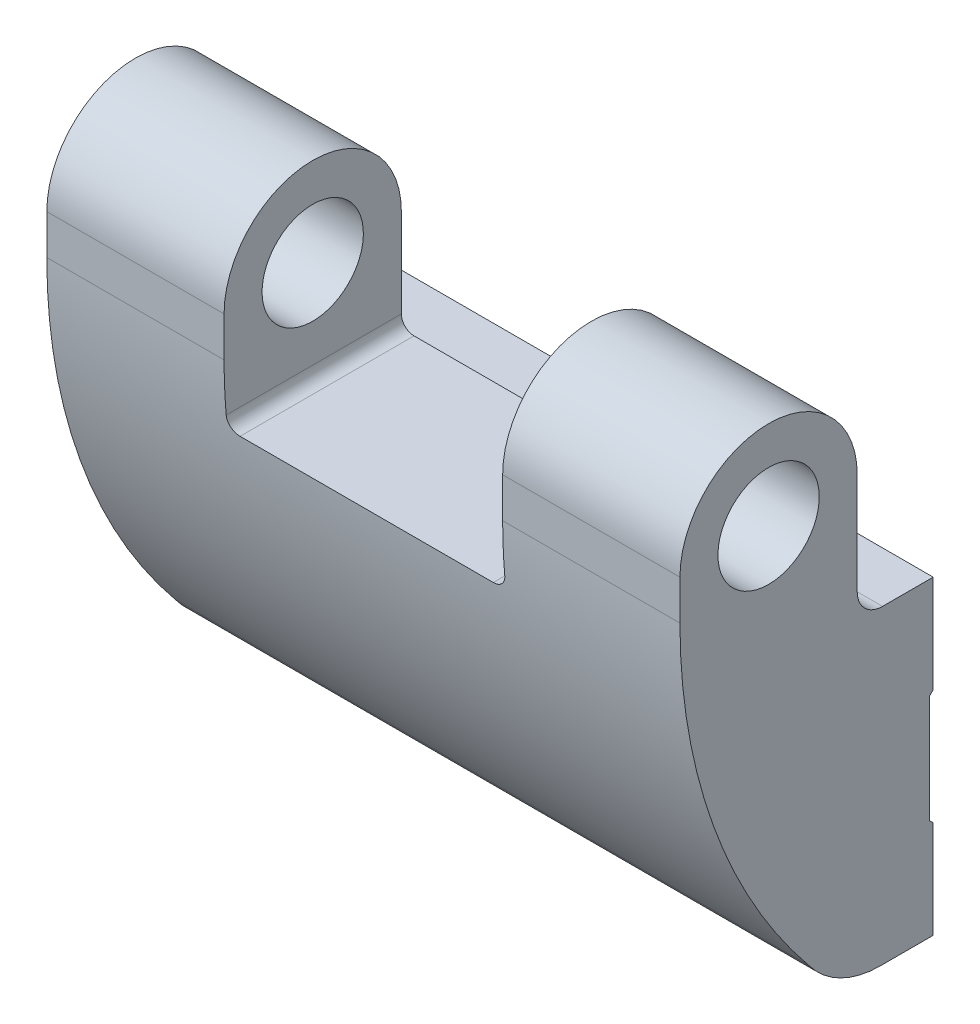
ISO-10303-21;
HEADER;
FILE_DESCRIPTION(('STEP AP214'),'2;1');
FILE_NAME('part.step','',(''),(''),'','','');
FILE_SCHEMA(('AUTOMOTIVE_DESIGN { 1 0 10303 214 1 1 1 1 }'));
ENDSEC;
DATA;
#1=APPLICATION_CONTEXT('core data for automotive mechanical design processes');
#2=APPLICATION_PROTOCOL_DEFINITION('international standard','automotive_design',2000,#1);
#3=PRODUCT_CONTEXT('',#1,'mechanical');
#4=PRODUCT('Part','Part','',(#3));
#5=PRODUCT_RELATED_PRODUCT_CATEGORY('part','',(#4));
#6=PRODUCT_DEFINITION_FORMATION('','',#4);
#7=PRODUCT_DEFINITION_CONTEXT('part definition',#1,'design');
#8=PRODUCT_DEFINITION('design','',#6,#7);
#9=PRODUCT_DEFINITION_SHAPE('','',#8);
#10=(LENGTH_UNIT() NAMED_UNIT(*) SI_UNIT(.MILLI.,.METRE.));
#11=(NAMED_UNIT(*) PLANE_ANGLE_UNIT() SI_UNIT($,.RADIAN.));
#12=(NAMED_UNIT(*) SI_UNIT($,.STERADIAN.) SOLID_ANGLE_UNIT());
#13=UNCERTAINTY_MEASURE_WITH_UNIT(LENGTH_MEASURE(1.E-05),#10,'distance_accuracy_value','');
#14=(GEOMETRIC_REPRESENTATION_CONTEXT(3) GLOBAL_UNCERTAINTY_ASSIGNED_CONTEXT((#13)) GLOBAL_UNIT_ASSIGNED_CONTEXT((#10,
#11,#12)) REPRESENTATION_CONTEXT('',''));
#15=CARTESIAN_POINT('',(0.,0.,0.));
#16=DIRECTION('',(0.,0.,1.));
#17=DIRECTION('',(1.,0.,0.));
#18=AXIS2_PLACEMENT_3D('',#15,#16,#17);
#19=CARTESIAN_POINT('',(-8.5,20.8580531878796,20.));
#20=DIRECTION('',(0.,0.,-1.));
#21=DIRECTION('',(1.,0.,0.));
#22=AXIS2_PLACEMENT_3D('',#19,#20,#21);
#23=PLANE('',#22);
#24=DIRECTION('',(0.,1.,0.));
#25=VECTOR('',#24,1.);
#26=CARTESIAN_POINT('',(27.5,17.,20.));
#27=LINE('',#26,#25);
#28=CARTESIAN_POINT('',(27.5,20.8580531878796,20.));
#29=VERTEX_POINT('',#28);
#30=CARTESIAN_POINT('',(27.5,24.,20.));
#31=VERTEX_POINT('',#30);
#32=EDGE_CURVE('E155',#29,#31,#27,.T.);
#33=ORIENTED_EDGE('',*,*,#32,.F.);
#34=DIRECTION('',(1.,0.,0.));
#35=VECTOR('',#34,1.);
#36=CARTESIAN_POINT('',(-8.5,20.8580531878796,20.));
#37=LINE('',#36,#35);
#38=CARTESIAN_POINT('',(41.5,20.8580531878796,20.));
#39=VERTEX_POINT('',#38);
#40=EDGE_CURVE('E165',#29,#39,#37,.T.);
#41=ORIENTED_EDGE('',*,*,#40,.T.);
#42=DIRECTION('',(0.,1.,0.));
#43=VECTOR('',#42,1.);
#44=CARTESIAN_POINT('',(41.5,20.8580531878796,20.));
#45=LINE('',#44,#43);
#46=CARTESIAN_POINT('',(41.5,24.,20.));
#47=VERTEX_POINT('',#46);
#48=EDGE_CURVE('E306',#39,#47,#45,.T.);
#49=ORIENTED_EDGE('',*,*,#48,.T.);
#50=DIRECTION('',(1.,0.,0.));
#51=VECTOR('',#50,1.);
#52=CARTESIAN_POINT('',(-8.5,24.,20.));
#53=LINE('',#52,#51);
#54=EDGE_CURVE('E167',#31,#47,#53,.T.);
#55=ORIENTED_EDGE('',*,*,#54,.F.);
#56=EDGE_LOOP('',(#33,#41,#49,#55));
#57=FACE_BOUND('',#56,.T.);
#58=ADVANCED_FACE('F14',(#57),#23,.F.);
#59=DIRECTION('',(0.,-1.,0.));
#60=VECTOR('',#59,1.);
#61=CARTESIAN_POINT('',(5.5,31.,20.));
#62=LINE('',#61,#60);
#63=CARTESIAN_POINT('',(5.5,24.,20.));
#64=VERTEX_POINT('',#63);
#65=CARTESIAN_POINT('',(5.5,20.8580531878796,20.));
#66=VERTEX_POINT('',#65);
#67=EDGE_CURVE('E168',#64,#66,#62,.T.);
#68=ORIENTED_EDGE('',*,*,#67,.F.);
#69=CARTESIAN_POINT('',(-8.5,24.,20.));
#70=VERTEX_POINT('',#69);
#71=EDGE_CURVE('E221',#70,#64,#53,.T.);
#72=ORIENTED_EDGE('',*,*,#71,.F.);
#73=DIRECTION('',(0.,1.,0.));
#74=VECTOR('',#73,1.);
#75=CARTESIAN_POINT('',(-8.5,20.8580531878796,20.));
#76=LINE('',#75,#74);
#77=CARTESIAN_POINT('',(-8.5,20.8580531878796,20.));
#78=VERTEX_POINT('',#77);
#79=EDGE_CURVE('E307',#78,#70,#76,.T.);
#80=ORIENTED_EDGE('',*,*,#79,.F.);
#81=EDGE_CURVE('E175',#78,#66,#37,.T.);
#82=ORIENTED_EDGE('',*,*,#81,.T.);
#83=EDGE_LOOP('',(#68,#72,#80,#82));
#84=FACE_BOUND('',#83,.T.);
#85=ADVANCED_FACE('F385',(#84),#23,.F.);
#86=CARTESIAN_POINT('',(-8.5,24.,13.));
#87=DIRECTION('',(1.,0.,0.));
#88=DIRECTION('',(0.,1.,0.));
#89=AXIS2_PLACEMENT_3D('',#86,#87,#88);
#90=CYLINDRICAL_SURFACE('',#89,7.);
#91=CARTESIAN_POINT('',(27.5,24.,13.));
#92=DIRECTION('',(-1.,0.,0.));
#93=DIRECTION('',(0.,-1.,0.));
#94=AXIS2_PLACEMENT_3D('',#91,#92,#93);
#95=CIRCLE('',#94,7.);
#96=CARTESIAN_POINT('',(27.5,24.,6.));
#97=VERTEX_POINT('',#96);
#98=EDGE_CURVE('E304',#31,#97,#95,.T.);
#99=ORIENTED_EDGE('',*,*,#98,.F.);
#100=ORIENTED_EDGE('',*,*,#54,.T.);
#101=CARTESIAN_POINT('',(41.5,24.,13.));
#102=DIRECTION('',(-1.,0.,0.));
#103=DIRECTION('',(0.,-1.,0.));
#104=AXIS2_PLACEMENT_3D('',#101,#102,#103);
#105=CIRCLE('',#104,7.);
#106=CARTESIAN_POINT('',(41.5,24.,6.));
#107=VERTEX_POINT('',#106);
#108=EDGE_CURVE('E335',#47,#107,#105,.T.);
#109=ORIENTED_EDGE('',*,*,#108,.T.);
#110=DIRECTION('',(1.,0.,0.));
#111=VECTOR('',#110,1.);
#112=CARTESIAN_POINT('',(-8.5,24.,6.));
#113=LINE('',#112,#111);
#114=EDGE_CURVE('E217',#97,#107,#113,.T.);
#115=ORIENTED_EDGE('',*,*,#114,.F.);
#116=EDGE_LOOP('',(#99,#100,#109,#115));
#117=FACE_BOUND('',#116,.T.);
#118=ADVANCED_FACE('F390',(#117),#90,.T.);
#119=CARTESIAN_POINT('',(5.5,24.,13.));
#120=DIRECTION('',(1.,0.,0.));
#121=DIRECTION('',(0.,1.,0.));
#122=AXIS2_PLACEMENT_3D('',#119,#120,#121);
#123=CIRCLE('',#122,7.);
#124=CARTESIAN_POINT('',(5.5,24.,6.));
#125=VERTEX_POINT('',#124);
#126=EDGE_CURVE('E297',#125,#64,#123,.T.);
#127=ORIENTED_EDGE('',*,*,#126,.F.);
#128=CARTESIAN_POINT('',(-8.5,24.,6.));
#129=VERTEX_POINT('',#128);
#130=EDGE_CURVE('E218',#129,#125,#113,.T.);
#131=ORIENTED_EDGE('',*,*,#130,.F.);
#132=CARTESIAN_POINT('',(-8.5,24.,13.));
#133=DIRECTION('',(-1.,0.,0.));
#134=DIRECTION('',(0.,-1.,0.));
#135=AXIS2_PLACEMENT_3D('',#132,#133,#134);
#136=CIRCLE('',#135,7.);
#137=EDGE_CURVE('E310',#70,#129,#136,.T.);
#138=ORIENTED_EDGE('',*,*,#137,.F.);
#139=ORIENTED_EDGE('',*,*,#71,.T.);
#140=EDGE_LOOP('',(#127,#131,#138,#139));
#141=FACE_BOUND('',#140,.T.);
#142=ADVANCED_FACE('F396',(#141),#90,.T.);
#143=CARTESIAN_POINT('',(-8.5,24.,6.));
#144=DIRECTION('',(0.,0.,1.));
#145=DIRECTION('',(-1.,0.,0.));
#146=AXIS2_PLACEMENT_3D('',#143,#144,#145);
#147=PLANE('',#146);
#148=DIRECTION('',(0.,1.,0.));
#149=VECTOR('',#148,1.);
#150=CARTESIAN_POINT('',(5.5,24.,6.));
#151=LINE('',#150,#149);
#152=CARTESIAN_POINT('',(5.5,17.,6.));
#153=VERTEX_POINT('',#152);
#154=EDGE_CURVE('E295',#153,#125,#151,.T.);
#155=ORIENTED_EDGE('',*,*,#154,.F.);
#156=CARTESIAN_POINT('',(6.5,17.,6.));
#157=DIRECTION('',(0.,0.,1.));
#158=DIRECTION('',(-1.,0.,0.));
#159=AXIS2_PLACEMENT_3D('',#156,#157,#158);
#160=CIRCLE('',#159,1.);
#161=CARTESIAN_POINT('',(6.5,16.,6.));
#162=VERTEX_POINT('',#161);
#163=EDGE_CURVE('E274',#162,#153,#160,.F.);
#164=ORIENTED_EDGE('',*,*,#163,.F.);
#165=DIRECTION('',(1.,0.,0.));
#166=VECTOR('',#165,1.);
#167=CARTESIAN_POINT('',(-8.5,16.,6.));
#168=LINE('',#167,#166);
#169=CARTESIAN_POINT('',(-8.5,16.,6.));
#170=VERTEX_POINT('',#169);
#171=EDGE_CURVE('E214',#170,#162,#168,.T.);
#172=ORIENTED_EDGE('',*,*,#171,.F.);
#173=DIRECTION('',(0.,-1.,0.));
#174=VECTOR('',#173,1.);
#175=CARTESIAN_POINT('',(-8.5,24.,6.));
#176=LINE('',#175,#174);
#177=EDGE_CURVE('E312',#129,#170,#176,.T.);
#178=ORIENTED_EDGE('',*,*,#177,.F.);
#179=ORIENTED_EDGE('',*,*,#130,.T.);
#180=EDGE_LOOP('',(#155,#164,#172,#178,#179));
#181=FACE_BOUND('',#180,.T.);
#182=ADVANCED_FACE('F370',(#181),#147,.F.);
#183=CARTESIAN_POINT('',(-8.5,24.,13.));
#184=DIRECTION('',(1.,0.,0.));
#185=DIRECTION('',(0.,1.,0.));
#186=AXIS2_PLACEMENT_3D('',#183,#184,#185);
#187=CYLINDRICAL_SURFACE('',#186,4.);
#188=CARTESIAN_POINT('',(41.5,24.,13.));
#189=DIRECTION('',(-1.,0.,0.));
#190=DIRECTION('',(0.,-1.,0.));
#191=AXIS2_PLACEMENT_3D('',#188,#189,#190);
#192=CIRCLE('',#191,4.);
#193=CARTESIAN_POINT('',(41.5,20.,13.));
#194=VERTEX_POINT('',#193);
#195=EDGE_CURVE('E185',#194,#194,#192,.T.);
#196=ORIENTED_EDGE('',*,*,#195,.F.);
#197=EDGE_LOOP('',(#196));
#198=FACE_BOUND('',#197,.T.);
#199=CARTESIAN_POINT('',(27.5,24.,13.));
#200=DIRECTION('',(-1.,0.,0.));
#201=DIRECTION('',(0.,-1.,0.));
#202=AXIS2_PLACEMENT_3D('',#199,#200,#201);
#203=CIRCLE('',#202,4.);
#204=CARTESIAN_POINT('',(27.5,20.,13.));
#205=VERTEX_POINT('',#204);
#206=EDGE_CURVE('E299',#205,#205,#203,.T.);
#207=ORIENTED_EDGE('',*,*,#206,.T.);
#208=EDGE_LOOP('',(#207));
#209=FACE_BOUND('',#208,.T.);
#210=ADVANCED_FACE('F366',(#198,#209),#187,.F.);
#211=CARTESIAN_POINT('',(-8.5,24.,13.));
#212=DIRECTION('',(-1.,0.,0.));
#213=DIRECTION('',(0.,-1.,0.));
#214=AXIS2_PLACEMENT_3D('',#211,#212,#213);
#215=CIRCLE('',#214,4.);
#216=CARTESIAN_POINT('',(-8.5,20.,13.));
#217=VERTEX_POINT('',#216);
#218=EDGE_CURVE('E176',#217,#217,#215,.T.);
#219=ORIENTED_EDGE('',*,*,#218,.T.);
#220=EDGE_LOOP('',(#219));
#221=FACE_BOUND('',#220,.T.);
#222=CARTESIAN_POINT('',(5.5,24.,13.));
#223=DIRECTION('',(1.,0.,0.));
#224=DIRECTION('',(0.,1.,0.));
#225=AXIS2_PLACEMENT_3D('',#222,#223,#224);
#226=CIRCLE('',#225,4.);
#227=CARTESIAN_POINT('',(5.5,28.,13.));
#228=VERTEX_POINT('',#227);
#229=EDGE_CURVE('E292',#228,#228,#226,.T.);
#230=ORIENTED_EDGE('',*,*,#229,.T.);
#231=EDGE_LOOP('',(#230));
#232=FACE_BOUND('',#231,.T.);
#233=ADVANCED_FACE('F369',(#221,#232),#187,.F.);
#234=CARTESIAN_POINT('',(-8.5,20.8580531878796,-25.));
#235=DIRECTION('',(1.,0.,0.));
#236=DIRECTION('',(0.,1.,0.));
#237=AXIS2_PLACEMENT_3D('',#234,#235,#236);
#238=CYLINDRICAL_SURFACE('',#237,45.);
#239=CARTESIAN_POINT('',(27.5,20.8580531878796,-25.));
#240=DIRECTION('',(-1.,0.,0.));
#241=DIRECTION('',(0.,-1.,0.));
#242=AXIS2_PLACEMENT_3D('',#239,#240,#241);
#243=CIRCLE('',#242,45.);
#244=CARTESIAN_POINT('',(27.5,17.,19.8343108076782));
#245=VERTEX_POINT('',#244);
#246=EDGE_CURVE('E9',#245,#29,#243,.T.);
#247=ORIENTED_EDGE('',*,*,#246,.F.);
#248=CARTESIAN_POINT('',(26.5,16.,19.7370016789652));
#249=CARTESIAN_POINT('',(26.5280224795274,16.0000000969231,19.7370015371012));
#250=CARTESIAN_POINT('',(26.5560314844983,16.0011786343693,19.7371296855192));
#251=CARTESIAN_POINT('',(26.6118479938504,16.0058797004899,19.7376398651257));
#252=CARTESIAN_POINT('',(26.6396555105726,16.0094020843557,19.7380218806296));
#253=CARTESIAN_POINT('',(26.7224180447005,16.0234487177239,19.7395428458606));
#254=CARTESIAN_POINT('',(26.7768169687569,16.0374525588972,19.7410567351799));
#255=CARTESIAN_POINT('',(26.8824737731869,16.0743377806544,19.7450154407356));
#256=CARTESIAN_POINT('',(26.9337303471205,16.0972228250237,19.7474606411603));
#257=CARTESIAN_POINT('',(27.0316681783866,16.151204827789,19.7531709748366));
#258=CARTESIAN_POINT('',(27.0783499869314,16.1823007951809,19.7564360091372));
#259=CARTESIAN_POINT('',(27.1659627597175,16.251913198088,19.7636537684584));
#260=CARTESIAN_POINT('',(27.2068768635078,16.2904506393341,19.7676084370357));
#261=CARTESIAN_POINT('',(27.2816713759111,16.3738008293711,19.7760341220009));
#262=CARTESIAN_POINT('',(27.3155502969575,16.418614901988,19.7805052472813));
#263=CARTESIAN_POINT('',(27.3754921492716,16.5135014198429,19.7898108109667));
#264=CARTESIAN_POINT('',(27.4015116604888,16.5636010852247,19.7946470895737));
#265=CARTESIAN_POINT('',(27.4447534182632,16.6674351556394,19.8044800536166));
#266=CARTESIAN_POINT('',(27.4619804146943,16.7211675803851,19.8094766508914));
#267=CARTESIAN_POINT('',(27.4830212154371,16.8126690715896,19.8178115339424));
#268=CARTESIAN_POINT('',(27.4893835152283,16.8498719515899,19.8211543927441));
#269=CARTESIAN_POINT('',(27.4978725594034,16.9247100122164,19.8277841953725));
#270=CARTESIAN_POINT('',(27.5000051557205,16.9623445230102,19.8310712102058));
#271=CARTESIAN_POINT('',(27.5,17.,19.8343108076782));
#272=B_SPLINE_CURVE_WITH_KNOTS('',3,(#248,#249,#250,#251,#252,#253,#254,#255,#256,#257,#258,
#259,#260,#261,#262,#263,#264,#265,#266,#267,#268,#269,#270,#271),.UNSPECIFIED.,.F.,.F.,(4,2,2,
2,2,2,2,2,2,2,2,4),(0.,0.0840156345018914,0.168026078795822,0.3357391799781,0.50352154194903,
0.671283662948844,0.83952645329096,1.00780478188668,1.17699645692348,1.34609663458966,
1.4595447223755,1.57283574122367),.UNSPECIFIED.);
#273=CARTESIAN_POINT('',(26.5,16.,19.7370016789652));
#274=VERTEX_POINT('',#273);
#275=EDGE_CURVE('E224',#274,#245,#272,.T.);
#276=ORIENTED_EDGE('',*,*,#275,.F.);
#277=DIRECTION('',(1.,0.,0.));
#278=VECTOR('',#277,1.);
#279=CARTESIAN_POINT('',(-8.5,16.,19.7370016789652));
#280=LINE('',#279,#278);
#281=CARTESIAN_POINT('',(6.5,16.,19.7370016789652));
#282=VERTEX_POINT('',#281);
#283=EDGE_CURVE('E232',#282,#274,#280,.T.);
#284=ORIENTED_EDGE('',*,*,#283,.F.);
#285=CARTESIAN_POINT('',(5.5,17.,19.8343108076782));
#286=CARTESIAN_POINT('',(5.50000023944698,16.971758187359,19.8318807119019));
#287=CARTESIAN_POINT('',(5.50119713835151,16.9435322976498,19.8294247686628));
#288=CARTESIAN_POINT('',(5.50597122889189,16.8872870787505,19.8244778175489));
#289=CARTESIAN_POINT('',(5.50954830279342,16.8592677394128,19.8219868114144));
#290=CARTESIAN_POINT('',(5.52381538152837,16.7758653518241,19.8144936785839));
#291=CARTESIAN_POINT('',(5.53804133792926,16.7210475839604,19.8094636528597));
#292=CARTESIAN_POINT('',(5.57552894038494,16.6145858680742,19.7995072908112));
#293=CARTESIAN_POINT('',(5.59879486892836,16.5629434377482,19.794581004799));
#294=CARTESIAN_POINT('',(5.65370863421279,16.4642996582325,19.7850129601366));
#295=CARTESIAN_POINT('',(5.68535492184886,16.4172974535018,19.7803711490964));
#296=CARTESIAN_POINT('',(5.75611521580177,16.329313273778,19.771558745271));
#297=CARTESIAN_POINT('',(5.79522304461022,16.2883263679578,19.7673877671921));
#298=CARTESIAN_POINT('',(5.87983508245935,16.2134983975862,19.7596864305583));
#299=CARTESIAN_POINT('',(5.92534045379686,16.1796586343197,19.7561561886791));
#300=CARTESIAN_POINT('',(6.02125534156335,16.1202414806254,19.7499053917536));
#301=CARTESIAN_POINT('',(6.071644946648,16.0946322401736,19.7471817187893));
#302=CARTESIAN_POINT('',(6.1760373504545,16.052257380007,19.7426506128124));
#303=CARTESIAN_POINT('',(6.23003772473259,16.0354858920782,19.7408425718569));
#304=CARTESIAN_POINT('',(6.32032983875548,16.0156080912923,19.7386945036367));
#305=CARTESIAN_POINT('',(6.3560345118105,16.0097586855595,19.738060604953));
#306=CARTESIAN_POINT('',(6.42782090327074,16.0019552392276,19.7372140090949));
#307=CARTESIAN_POINT('',(6.46390201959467,15.9999957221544,19.7370007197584));
#308=CARTESIAN_POINT('',(6.5,16.,19.7370016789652));
#309=B_SPLINE_CURVE_WITH_KNOTS('',3,(#285,#286,#287,#288,#289,#290,#291,#292,#293,#294,#295,
#296,#297,#298,#299,#300,#301,#302,#303,#304,#305,#306,#307,#308),.UNSPECIFIED.,.F.,.F.,(4,2,2,
2,2,2,2,2,2,2,2,4),(0.,0.0849861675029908,0.169968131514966,0.339663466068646,0.509439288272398,
0.679183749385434,0.848788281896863,1.0184236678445,1.18739447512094,1.35625294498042,
1.46461294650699,1.57282028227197),.UNSPECIFIED.);
#310=CARTESIAN_POINT('',(5.5,17.,19.8343108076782));
#311=VERTEX_POINT('',#310);
#312=EDGE_CURVE('E256',#311,#282,#309,.T.);
#313=ORIENTED_EDGE('',*,*,#312,.F.);
#314=CARTESIAN_POINT('',(5.5,20.8580531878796,-25.));
#315=DIRECTION('',(1.,0.,0.));
#316=DIRECTION('',(0.,1.,0.));
#317=AXIS2_PLACEMENT_3D('',#314,#315,#316);
#318=CIRCLE('',#317,45.);
#319=EDGE_CURVE('E21',#66,#311,#318,.T.);
#320=ORIENTED_EDGE('',*,*,#319,.F.);
#321=ORIENTED_EDGE('',*,*,#81,.F.);
#322=CARTESIAN_POINT('',(-8.5,20.8580531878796,-25.));
#323=DIRECTION('',(-1.,0.,0.));
#324=DIRECTION('',(0.,-1.,0.));
#325=AXIS2_PLACEMENT_3D('',#322,#323,#324);
#326=CIRCLE('',#325,45.);
#327=CARTESIAN_POINT('',(-8.5,-7.66,9.80977797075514));
#328=VERTEX_POINT('',#327);
#329=EDGE_CURVE('E181',#328,#78,#326,.T.);
#330=ORIENTED_EDGE('',*,*,#329,.F.);
#331=DIRECTION('',(1.,0.,0.));
#332=VECTOR('',#331,1.);
#333=CARTESIAN_POINT('',(-8.5,-7.66,9.80977797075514));
#334=LINE('',#333,#332);
#335=CARTESIAN_POINT('',(41.5,-7.66,9.80977797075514));
#336=VERTEX_POINT('',#335);
#337=EDGE_CURVE('E179',#328,#336,#334,.T.);
#338=ORIENTED_EDGE('',*,*,#337,.T.);
#339=CARTESIAN_POINT('',(41.5,20.8580531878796,-25.));
#340=DIRECTION('',(-1.,0.,0.));
#341=DIRECTION('',(0.,-1.,0.));
#342=AXIS2_PLACEMENT_3D('',#339,#340,#341);
#343=CIRCLE('',#342,45.);
#344=EDGE_CURVE('E173',#336,#39,#343,.T.);
#345=ORIENTED_EDGE('',*,*,#344,.T.);
#346=ORIENTED_EDGE('',*,*,#40,.F.);
#347=EDGE_LOOP('',(#247,#276,#284,#313,#320,#321,#330,#338,#345,#346));
#348=FACE_BOUND('',#347,.T.);
#349=ADVANCED_FACE('F170',(#348),#238,.T.);
#350=DIRECTION('',(0.,-1.,0.));
#351=VECTOR('',#350,1.);
#352=CARTESIAN_POINT('',(27.5,24.,6.));
#353=LINE('',#352,#351);
#354=CARTESIAN_POINT('',(27.5,17.,6.));
#355=VERTEX_POINT('',#354);
#356=EDGE_CURVE('E302',#97,#355,#353,.T.);
#357=ORIENTED_EDGE('',*,*,#356,.F.);
#358=ORIENTED_EDGE('',*,*,#114,.T.);
#359=DIRECTION('',(0.,-1.,0.));
#360=VECTOR('',#359,1.);
#361=CARTESIAN_POINT('',(41.5,24.,6.));
#362=LINE('',#361,#360);
#363=CARTESIAN_POINT('',(41.5,16.,6.));
#364=VERTEX_POINT('',#363);
#365=EDGE_CURVE('E338',#107,#364,#362,.T.);
#366=ORIENTED_EDGE('',*,*,#365,.T.);
#367=CARTESIAN_POINT('',(26.5,16.,6.));
#368=VERTEX_POINT('',#367);
#369=EDGE_CURVE('E213',#368,#364,#168,.T.);
#370=ORIENTED_EDGE('',*,*,#369,.F.);
#371=CARTESIAN_POINT('',(26.5,17.,6.));
#372=DIRECTION('',(0.,0.,1.));
#373=DIRECTION('',(-1.,0.,0.));
#374=AXIS2_PLACEMENT_3D('',#371,#372,#373);
#375=CIRCLE('',#374,1.);
#376=EDGE_CURVE('E275',#355,#368,#375,.F.);
#377=ORIENTED_EDGE('',*,*,#376,.F.);
#378=EDGE_LOOP('',(#357,#358,#366,#370,#377));
#379=FACE_BOUND('',#378,.T.);
#380=ADVANCED_FACE('F417',(#379),#147,.F.);
#381=CARTESIAN_POINT('',(-8.5,16.,4.));
#382=DIRECTION('',(1.,0.,0.));
#383=DIRECTION('',(0.,1.,0.));
#384=AXIS2_PLACEMENT_3D('',#381,#382,#383);
#385=CYLINDRICAL_SURFACE('',#384,2.);
#386=CARTESIAN_POINT('',(41.5,16.,4.));
#387=DIRECTION('',(-1.,0.,0.));
#388=DIRECTION('',(0.,-1.,0.));
#389=AXIS2_PLACEMENT_3D('',#386,#387,#388);
#390=CIRCLE('',#389,2.);
#391=CARTESIAN_POINT('',(41.5,14.,4.));
#392=VERTEX_POINT('',#391);
#393=EDGE_CURVE('E341',#392,#364,#390,.T.);
#394=ORIENTED_EDGE('',*,*,#393,.F.);
#395=DIRECTION('',(1.,0.,0.));
#396=VECTOR('',#395,1.);
#397=CARTESIAN_POINT('',(-8.5,14.,4.));
#398=LINE('',#397,#396);
#399=CARTESIAN_POINT('',(-8.5,14.,4.));
#400=VERTEX_POINT('',#399);
#401=EDGE_CURVE('E211',#400,#392,#398,.T.);
#402=ORIENTED_EDGE('',*,*,#401,.F.);
#403=CARTESIAN_POINT('',(-8.5,16.,4.));
#404=DIRECTION('',(-1.,0.,0.));
#405=DIRECTION('',(0.,-1.,0.));
#406=AXIS2_PLACEMENT_3D('',#403,#404,#405);
#407=CIRCLE('',#406,2.);
#408=EDGE_CURVE('E314',#400,#170,#407,.T.);
#409=ORIENTED_EDGE('',*,*,#408,.T.);
#410=ORIENTED_EDGE('',*,*,#171,.T.);
#411=DIRECTION('',(1.,0.,0.));
#412=VECTOR('',#411,1.);
#413=CARTESIAN_POINT('',(-8.5,16.,6.));
#414=LINE('',#413,#412);
#415=EDGE_CURVE('E284',#162,#368,#414,.T.);
#416=ORIENTED_EDGE('',*,*,#415,.T.);
#417=ORIENTED_EDGE('',*,*,#369,.T.);
#418=EDGE_LOOP('',(#394,#402,#409,#410,#416,#417));
#419=FACE_BOUND('',#418,.T.);
#420=ADVANCED_FACE('F556',(#419),#385,.F.);
#421=CARTESIAN_POINT('',(-8.5,14.,4.));
#422=DIRECTION('',(0.,-1.,0.));
#423=DIRECTION('',(1.,0.,0.));
#424=AXIS2_PLACEMENT_3D('',#421,#422,#423);
#425=PLANE('',#424);
#426=DIRECTION('',(0.,0.,-1.));
#427=VECTOR('',#426,1.);
#428=CARTESIAN_POINT('',(41.5,14.,4.));
#429=LINE('',#428,#427);
#430=CARTESIAN_POINT('',(41.5,14.,0.));
#431=VERTEX_POINT('',#430);
#432=EDGE_CURVE('E344',#392,#431,#429,.T.);
#433=ORIENTED_EDGE('',*,*,#432,.T.);
#434=DIRECTION('',(1.,0.,0.));
#435=VECTOR('',#434,1.);
#436=CARTESIAN_POINT('',(-8.5,14.,0.));
#437=LINE('',#436,#435);
#438=CARTESIAN_POINT('',(-8.5,14.,0.));
#439=VERTEX_POINT('',#438);
#440=EDGE_CURVE('E208',#439,#431,#437,.T.);
#441=ORIENTED_EDGE('',*,*,#440,.F.);
#442=DIRECTION('',(0.,0.,-1.));
#443=VECTOR('',#442,1.);
#444=CARTESIAN_POINT('',(-8.5,14.,4.));
#445=LINE('',#444,#443);
#446=EDGE_CURVE('E317',#400,#439,#445,.T.);
#447=ORIENTED_EDGE('',*,*,#446,.F.);
#448=ORIENTED_EDGE('',*,*,#401,.T.);
#449=EDGE_LOOP('',(#433,#441,#447,#448));
#450=FACE_BOUND('',#449,.T.);
#451=ADVANCED_FACE('F563',(#450),#425,.F.);
#452=CARTESIAN_POINT('',(-8.5,14.,0.));
#453=DIRECTION('',(0.,0.,1.));
#454=DIRECTION('',(-1.,0.,0.));
#455=AXIS2_PLACEMENT_3D('',#452,#453,#454);
#456=PLANE('',#455);
#457=DIRECTION('',(0.,-1.,0.));
#458=VECTOR('',#457,1.);
#459=CARTESIAN_POINT('',(41.5,14.,0.));
#460=LINE('',#459,#458);
#461=CARTESIAN_POINT('',(41.5,6.3,0.));
#462=VERTEX_POINT('',#461);
#463=EDGE_CURVE('E346',#431,#462,#460,.T.);
#464=ORIENTED_EDGE('',*,*,#463,.T.);
#465=DIRECTION('',(1.,0.,0.));
#466=VECTOR('',#465,1.);
#467=CARTESIAN_POINT('',(-8.5,6.3,0.));
#468=LINE('',#467,#466);
#469=CARTESIAN_POINT('',(-8.5,6.3,0.));
#470=VERTEX_POINT('',#469);
#471=EDGE_CURVE('E205',#470,#462,#468,.T.);
#472=ORIENTED_EDGE('',*,*,#471,.F.);
#473=DIRECTION('',(0.,-1.,0.));
#474=VECTOR('',#473,1.);
#475=CARTESIAN_POINT('',(-8.5,14.,0.));
#476=LINE('',#475,#474);
#477=EDGE_CURVE('E319',#439,#470,#476,.T.);
#478=ORIENTED_EDGE('',*,*,#477,.F.);
#479=ORIENTED_EDGE('',*,*,#440,.T.);
#480=EDGE_LOOP('',(#464,#472,#478,#479));
#481=FACE_BOUND('',#480,.T.);
#482=ADVANCED_FACE('F572',(#481),#456,.F.);
#483=CARTESIAN_POINT('',(-8.5,6.3,0.));
#484=DIRECTION('',(0.,0.707106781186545,0.707106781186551));
#485=DIRECTION('',(0.,0.707106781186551,-0.707106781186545));
#486=AXIS2_PLACEMENT_3D('',#483,#484,#485);
#487=PLANE('',#486);
#488=DIRECTION('',(0.,-0.70710678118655,0.707106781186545));
#489=VECTOR('',#488,1.);
#490=CARTESIAN_POINT('',(41.5,6.3,0.));
#491=LINE('',#490,#489);
#492=CARTESIAN_POINT('',(41.5,6.,0.299999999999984));
#493=VERTEX_POINT('',#492);
#494=EDGE_CURVE('E348',#462,#493,#491,.T.);
#495=ORIENTED_EDGE('',*,*,#494,.T.);
#496=DIRECTION('',(1.,0.,0.));
#497=VECTOR('',#496,1.);
#498=CARTESIAN_POINT('',(-8.5,6.,0.299999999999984));
#499=LINE('',#498,#497);
#500=CARTESIAN_POINT('',(-8.5,6.,0.299999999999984));
#501=VERTEX_POINT('',#500);
#502=EDGE_CURVE('E201',#501,#493,#499,.T.);
#503=ORIENTED_EDGE('',*,*,#502,.F.);
#504=DIRECTION('',(0.,-0.70710678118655,0.707106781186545));
#505=VECTOR('',#504,1.);
#506=CARTESIAN_POINT('',(-8.5,6.3,0.));
#507=LINE('',#506,#505);
#508=EDGE_CURVE('E321',#470,#501,#507,.T.);
#509=ORIENTED_EDGE('',*,*,#508,.F.);
#510=ORIENTED_EDGE('',*,*,#471,.T.);
#511=EDGE_LOOP('',(#495,#503,#509,#510));
#512=FACE_BOUND('',#511,.T.);
#513=ADVANCED_FACE('F581',(#512),#487,.F.);
#514=CARTESIAN_POINT('',(-8.5,6.,0.299999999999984));
#515=DIRECTION('',(0.,0.,1.));
#516=DIRECTION('',(-1.,0.,0.));
#517=AXIS2_PLACEMENT_3D('',#514,#515,#516);
#518=PLANE('',#517);
#519=DIRECTION('',(1.,0.,0.));
#520=VECTOR('',#519,1.);
#521=CARTESIAN_POINT('',(-8.5,-2.5,0.299999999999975));
#522=LINE('',#521,#520);
#523=CARTESIAN_POINT('',(0.,-2.5,0.299999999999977));
#524=VERTEX_POINT('',#523);
#525=CARTESIAN_POINT('',(33.,-2.5,0.299999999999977));
#526=VERTEX_POINT('',#525);
#527=EDGE_CURVE('E202',#524,#526,#522,.T.);
#528=ORIENTED_EDGE('',*,*,#527,.F.);
#529=CARTESIAN_POINT('',(0.,0.,0.299999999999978));
#530=DIRECTION('',(0.,0.,1.));
#531=DIRECTION('',(-1.,0.,0.));
#532=AXIS2_PLACEMENT_3D('',#529,#530,#531);
#533=CIRCLE('',#532,2.5);
#534=EDGE_CURVE('E31',#524,#524,#533,.T.);
#535=ORIENTED_EDGE('',*,*,#534,.T.);
#536=CARTESIAN_POINT('',(-8.5,-2.5,0.299999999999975));
#537=VERTEX_POINT('',#536);
#538=EDGE_CURVE('E198',#537,#524,#522,.T.);
#539=ORIENTED_EDGE('',*,*,#538,.F.);
#540=DIRECTION('',(0.,-1.,0.));
#541=VECTOR('',#540,1.);
#542=CARTESIAN_POINT('',(-8.5,6.,0.299999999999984));
#543=LINE('',#542,#541);
#544=EDGE_CURVE('E323',#501,#537,#543,.T.);
#545=ORIENTED_EDGE('',*,*,#544,.F.);
#546=ORIENTED_EDGE('',*,*,#502,.T.);
#547=DIRECTION('',(0.,-1.,0.));
#548=VECTOR('',#547,1.);
#549=CARTESIAN_POINT('',(41.5,6.,0.299999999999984));
#550=LINE('',#549,#548);
#551=CARTESIAN_POINT('',(41.5,-2.5,0.299999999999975));
#552=VERTEX_POINT('',#551);
#553=EDGE_CURVE('E350',#493,#552,#550,.T.);
#554=ORIENTED_EDGE('',*,*,#553,.T.);
#555=EDGE_CURVE('E197',#526,#552,#522,.T.);
#556=ORIENTED_EDGE('',*,*,#555,.F.);
#557=CARTESIAN_POINT('',(33.,0.,0.299999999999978));
#558=DIRECTION('',(0.,0.,1.));
#559=DIRECTION('',(-1.,0.,0.));
#560=AXIS2_PLACEMENT_3D('',#557,#558,#559);
#561=CIRCLE('',#560,2.5);
#562=EDGE_CURVE('E26',#526,#526,#561,.T.);
#563=ORIENTED_EDGE('',*,*,#562,.T.);
#564=EDGE_LOOP('',(#528,#535,#539,#545,#546,#554,#556,#563));
#565=FACE_BOUND('',#564,.T.);
#566=ADVANCED_FACE('F590',(#565),#518,.F.);
#567=CARTESIAN_POINT('',(-8.5,-2.5,0.299999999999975));
#568=DIRECTION('',(0.,-0.707106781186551,0.707106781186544));
#569=DIRECTION('',(0.,0.707106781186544,0.707106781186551));
#570=AXIS2_PLACEMENT_3D('',#567,#568,#569);
#571=PLANE('',#570);
#572=DIRECTION('',(0.,-0.707106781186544,-0.707106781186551));
#573=VECTOR('',#572,1.);
#574=CARTESIAN_POINT('',(41.5,-2.5,0.299999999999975));
#575=LINE('',#574,#573);
#576=CARTESIAN_POINT('',(41.5,-2.8,0.));
#577=VERTEX_POINT('',#576);
#578=EDGE_CURVE('E353',#552,#577,#575,.T.);
#579=ORIENTED_EDGE('',*,*,#578,.T.);
#580=DIRECTION('',(1.,0.,0.));
#581=VECTOR('',#580,1.);
#582=CARTESIAN_POINT('',(-8.5,-2.8,0.));
#583=LINE('',#582,#581);
#584=CARTESIAN_POINT('',(-8.5,-2.8,0.));
#585=VERTEX_POINT('',#584);
#586=EDGE_CURVE('E194',#585,#577,#583,.T.);
#587=ORIENTED_EDGE('',*,*,#586,.F.);
#588=DIRECTION('',(0.,-0.707106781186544,-0.707106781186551));
#589=VECTOR('',#588,1.);
#590=CARTESIAN_POINT('',(-8.5,-2.5,0.299999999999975));
#591=LINE('',#590,#589);
#592=EDGE_CURVE('E325',#537,#585,#591,.T.);
#593=ORIENTED_EDGE('',*,*,#592,.F.);
#594=ORIENTED_EDGE('',*,*,#538,.T.);
#595=ORIENTED_EDGE('',*,*,#527,.T.);
#596=ORIENTED_EDGE('',*,*,#555,.T.);
#597=EDGE_LOOP('',(#579,#587,#593,#594,#595,#596));
#598=FACE_BOUND('',#597,.T.);
#599=ADVANCED_FACE('F599',(#598),#571,.F.);
#600=CARTESIAN_POINT('',(-8.5,-2.8,0.));
#601=DIRECTION('',(0.,0.,1.));
#602=DIRECTION('',(0.,1.,0.));
#603=AXIS2_PLACEMENT_3D('',#600,#601,#602);
#604=PLANE('',#603);
#605=DIRECTION('',(0.,-1.,0.));
#606=VECTOR('',#605,1.);
#607=CARTESIAN_POINT('',(41.5,-2.8,0.));
#608=LINE('',#607,#606);
#609=CARTESIAN_POINT('',(41.5,-10.5,0.));
#610=VERTEX_POINT('',#609);
#611=EDGE_CURVE('E355',#577,#610,#608,.T.);
#612=ORIENTED_EDGE('',*,*,#611,.T.);
#613=DIRECTION('',(1.,0.,0.));
#614=VECTOR('',#613,1.);
#615=CARTESIAN_POINT('',(-8.5,-10.5,0.));
#616=LINE('',#615,#614);
#617=CARTESIAN_POINT('',(-8.5,-10.5,0.));
#618=VERTEX_POINT('',#617);
#619=EDGE_CURVE('E191',#618,#610,#616,.T.);
#620=ORIENTED_EDGE('',*,*,#619,.F.);
#621=DIRECTION('',(0.,-1.,0.));
#622=VECTOR('',#621,1.);
#623=CARTESIAN_POINT('',(-8.5,-2.8,0.));
#624=LINE('',#623,#622);
#625=EDGE_CURVE('E327',#585,#618,#624,.T.);
#626=ORIENTED_EDGE('',*,*,#625,.F.);
#627=ORIENTED_EDGE('',*,*,#586,.T.);
#628=EDGE_LOOP('',(#612,#620,#626,#627));
#629=FACE_BOUND('',#628,.T.);
#630=ADVANCED_FACE('F608',(#629),#604,.F.);
#631=CARTESIAN_POINT('',(-8.5,-10.5,0.));
#632=DIRECTION('',(0.,1.,0.));
#633=DIRECTION('',(-1.,0.,0.));
#634=AXIS2_PLACEMENT_3D('',#631,#632,#633);
#635=PLANE('',#634);
#636=DIRECTION('',(0.,0.,1.));
#637=VECTOR('',#636,1.);
#638=CARTESIAN_POINT('',(41.5,-10.5,0.));
#639=LINE('',#638,#637);
#640=CARTESIAN_POINT('',(41.5,-10.5,4.18));
#641=VERTEX_POINT('',#640);
#642=EDGE_CURVE('E357',#610,#641,#639,.T.);
#643=ORIENTED_EDGE('',*,*,#642,.T.);
#644=DIRECTION('',(1.,0.,0.));
#645=VECTOR('',#644,1.);
#646=CARTESIAN_POINT('',(-8.5,-10.5,4.18));
#647=LINE('',#646,#645);
#648=CARTESIAN_POINT('',(-8.5,-10.5,4.18));
#649=VERTEX_POINT('',#648);
#650=EDGE_CURVE('E188',#649,#641,#647,.T.);
#651=ORIENTED_EDGE('',*,*,#650,.F.);
#652=DIRECTION('',(0.,0.,1.));
#653=VECTOR('',#652,1.);
#654=CARTESIAN_POINT('',(-8.5,-10.5,0.));
#655=LINE('',#654,#653);
#656=EDGE_CURVE('E329',#618,#649,#655,.T.);
#657=ORIENTED_EDGE('',*,*,#656,.F.);
#658=ORIENTED_EDGE('',*,*,#619,.T.);
#659=EDGE_LOOP('',(#643,#651,#657,#658));
#660=FACE_BOUND('',#659,.T.);
#661=ADVANCED_FACE('F617',(#660),#635,.F.);
#662=CARTESIAN_POINT('',(-8.5,-3.5,4.18));
#663=DIRECTION('',(1.,0.,0.));
#664=DIRECTION('',(0.,1.,0.));
#665=AXIS2_PLACEMENT_3D('',#662,#663,#664);
#666=CYLINDRICAL_SURFACE('',#665,7.);
#667=CARTESIAN_POINT('',(41.5,-3.5,4.18));
#668=DIRECTION('',(-1.,0.,0.));
#669=DIRECTION('',(0.,-1.,0.));
#670=AXIS2_PLACEMENT_3D('',#667,#668,#669);
#671=CIRCLE('',#670,7.);
#672=EDGE_CURVE('E359',#641,#336,#671,.T.);
#673=ORIENTED_EDGE('',*,*,#672,.T.);
#674=ORIENTED_EDGE('',*,*,#337,.F.);
#675=CARTESIAN_POINT('',(-8.5,-3.5,4.18));
#676=DIRECTION('',(-1.,0.,0.));
#677=DIRECTION('',(0.,-1.,0.));
#678=AXIS2_PLACEMENT_3D('',#675,#676,#677);
#679=CIRCLE('',#678,7.);
#680=EDGE_CURVE('E331',#649,#328,#679,.T.);
#681=ORIENTED_EDGE('',*,*,#680,.F.);
#682=ORIENTED_EDGE('',*,*,#650,.T.);
#683=EDGE_LOOP('',(#673,#674,#681,#682));
#684=FACE_BOUND('',#683,.T.);
#685=ADVANCED_FACE('F626',(#684),#666,.T.);
#686=CARTESIAN_POINT('',(-8.5,24.,13.));
#687=DIRECTION('',(-1.,0.,0.));
#688=DIRECTION('',(0.,-1.,0.));
#689=AXIS2_PLACEMENT_3D('',#686,#687,#688);
#690=PLANE('',#689);
#691=ORIENTED_EDGE('',*,*,#218,.F.);
#692=EDGE_LOOP('',(#691));
#693=FACE_BOUND('',#692,.T.);
#694=ORIENTED_EDGE('',*,*,#79,.T.);
#695=ORIENTED_EDGE('',*,*,#137,.T.);
#696=ORIENTED_EDGE('',*,*,#177,.T.);
#697=ORIENTED_EDGE('',*,*,#408,.F.);
#698=ORIENTED_EDGE('',*,*,#446,.T.);
#699=ORIENTED_EDGE('',*,*,#477,.T.);
#700=ORIENTED_EDGE('',*,*,#508,.T.);
#701=ORIENTED_EDGE('',*,*,#544,.T.);
#702=ORIENTED_EDGE('',*,*,#592,.T.);
#703=ORIENTED_EDGE('',*,*,#625,.T.);
#704=ORIENTED_EDGE('',*,*,#656,.T.);
#705=ORIENTED_EDGE('',*,*,#680,.T.);
#706=ORIENTED_EDGE('',*,*,#329,.T.);
#707=EDGE_LOOP('',(#694,#695,#696,#697,#698,#699,#700,#701,#702,#703,#704,#705,#706));
#708=FACE_BOUND('',#707,.T.);
#709=ADVANCED_FACE('F381',(#693,#708),#690,.T.);
#710=CARTESIAN_POINT('',(41.5,24.,13.));
#711=DIRECTION('',(-1.,0.,0.));
#712=DIRECTION('',(0.,-1.,0.));
#713=AXIS2_PLACEMENT_3D('',#710,#711,#712);
#714=PLANE('',#713);
#715=ORIENTED_EDGE('',*,*,#195,.T.);
#716=EDGE_LOOP('',(#715));
#717=FACE_BOUND('',#716,.T.);
#718=ORIENTED_EDGE('',*,*,#48,.F.);
#719=ORIENTED_EDGE('',*,*,#344,.F.);
#720=ORIENTED_EDGE('',*,*,#672,.F.);
#721=ORIENTED_EDGE('',*,*,#642,.F.);
#722=ORIENTED_EDGE('',*,*,#611,.F.);
#723=ORIENTED_EDGE('',*,*,#578,.F.);
#724=ORIENTED_EDGE('',*,*,#553,.F.);
#725=ORIENTED_EDGE('',*,*,#494,.F.);
#726=ORIENTED_EDGE('',*,*,#463,.F.);
#727=ORIENTED_EDGE('',*,*,#432,.F.);
#728=ORIENTED_EDGE('',*,*,#393,.T.);
#729=ORIENTED_EDGE('',*,*,#365,.F.);
#730=ORIENTED_EDGE('',*,*,#108,.F.);
#731=EDGE_LOOP('',(#718,#719,#720,#721,#722,#723,#724,#725,#726,#727,#728,#729,#730));
#732=FACE_BOUND('',#731,.T.);
#733=ADVANCED_FACE('F363',(#717,#732),#714,.F.);
#734=CARTESIAN_POINT('',(27.5,17.,20.));
#735=DIRECTION('',(-1.,0.,0.));
#736=DIRECTION('',(0.,-1.,0.));
#737=AXIS2_PLACEMENT_3D('',#734,#735,#736);
#738=PLANE('',#737);
#739=ORIENTED_EDGE('',*,*,#206,.F.);
#740=EDGE_LOOP('',(#739));
#741=FACE_BOUND('',#740,.T.);
#742=ORIENTED_EDGE('',*,*,#98,.T.);
#743=ORIENTED_EDGE('',*,*,#356,.T.);
#744=DIRECTION('',(0.,0.,-1.));
#745=VECTOR('',#744,1.);
#746=CARTESIAN_POINT('',(27.5,17.,20.));
#747=LINE('',#746,#745);
#748=EDGE_CURVE('E158',#245,#355,#747,.T.);
#749=ORIENTED_EDGE('',*,*,#748,.F.);
#750=ORIENTED_EDGE('',*,*,#246,.T.);
#751=ORIENTED_EDGE('',*,*,#32,.T.);
#752=EDGE_LOOP('',(#742,#743,#749,#750,#751));
#753=FACE_BOUND('',#752,.T.);
#754=ADVANCED_FACE('F154',(#741,#753),#738,.T.);
#755=CARTESIAN_POINT('',(5.5,31.,20.));
#756=DIRECTION('',(1.,0.,0.));
#757=DIRECTION('',(0.,1.,0.));
#758=AXIS2_PLACEMENT_3D('',#755,#756,#757);
#759=PLANE('',#758);
#760=ORIENTED_EDGE('',*,*,#229,.F.);
#761=EDGE_LOOP('',(#760));
#762=FACE_BOUND('',#761,.T.);
#763=ORIENTED_EDGE('',*,*,#126,.T.);
#764=ORIENTED_EDGE('',*,*,#67,.T.);
#765=ORIENTED_EDGE('',*,*,#319,.T.);
#766=DIRECTION('',(0.,0.,-1.));
#767=VECTOR('',#766,1.);
#768=CARTESIAN_POINT('',(5.5,17.,20.));
#769=LINE('',#768,#767);
#770=EDGE_CURVE('E266',#311,#153,#769,.T.);
#771=ORIENTED_EDGE('',*,*,#770,.T.);
#772=ORIENTED_EDGE('',*,*,#154,.T.);
#773=EDGE_LOOP('',(#763,#764,#765,#771,#772));
#774=FACE_BOUND('',#773,.T.);
#775=ADVANCED_FACE('F253',(#762,#774),#759,.T.);
#776=CARTESIAN_POINT('',(6.5,17.,20.));
#777=DIRECTION('',(0.,0.,-1.));
#778=DIRECTION('',(1.,0.,0.));
#779=AXIS2_PLACEMENT_3D('',#776,#777,#778);
#780=CYLINDRICAL_SURFACE('',#779,1.);
#781=ORIENTED_EDGE('',*,*,#163,.T.);
#782=ORIENTED_EDGE('',*,*,#770,.F.);
#783=ORIENTED_EDGE('',*,*,#312,.T.);
#784=DIRECTION('',(0.,0.,-1.));
#785=VECTOR('',#784,1.);
#786=CARTESIAN_POINT('',(6.5,16.,20.));
#787=LINE('',#786,#785);
#788=EDGE_CURVE('E276',#282,#162,#787,.T.);
#789=ORIENTED_EDGE('',*,*,#788,.T.);
#790=EDGE_LOOP('',(#781,#782,#783,#789));
#791=FACE_BOUND('',#790,.T.);
#792=ADVANCED_FACE('F248',(#791),#780,.F.);
#793=CARTESIAN_POINT('',(6.5,16.,20.));
#794=DIRECTION('',(0.,1.,0.));
#795=DIRECTION('',(-1.,0.,0.));
#796=AXIS2_PLACEMENT_3D('',#793,#794,#795);
#797=PLANE('',#796);
#798=ORIENTED_EDGE('',*,*,#788,.F.);
#799=ORIENTED_EDGE('',*,*,#283,.T.);
#800=DIRECTION('',(0.,0.,-1.));
#801=VECTOR('',#800,1.);
#802=CARTESIAN_POINT('',(26.5,16.,20.));
#803=LINE('',#802,#801);
#804=EDGE_CURVE('E281',#274,#368,#803,.T.);
#805=ORIENTED_EDGE('',*,*,#804,.T.);
#806=ORIENTED_EDGE('',*,*,#415,.F.);
#807=EDGE_LOOP('',(#798,#799,#805,#806));
#808=FACE_BOUND('',#807,.T.);
#809=ADVANCED_FACE('F243',(#808),#797,.T.);
#810=CARTESIAN_POINT('',(26.5,17.,20.));
#811=DIRECTION('',(0.,0.,-1.));
#812=DIRECTION('',(1.,0.,0.));
#813=AXIS2_PLACEMENT_3D('',#810,#811,#812);
#814=CYLINDRICAL_SURFACE('',#813,1.);
#815=ORIENTED_EDGE('',*,*,#376,.T.);
#816=ORIENTED_EDGE('',*,*,#804,.F.);
#817=ORIENTED_EDGE('',*,*,#275,.T.);
#818=ORIENTED_EDGE('',*,*,#748,.T.);
#819=EDGE_LOOP('',(#815,#816,#817,#818));
#820=FACE_BOUND('',#819,.T.);
#821=ADVANCED_FACE('F237',(#820),#814,.F.);
#822=CARTESIAN_POINT('',(33.,0.,10.));
#823=DIRECTION('',(0.,0.,-1.));
#824=DIRECTION('',(0.,-1.,0.));
#825=AXIS2_PLACEMENT_3D('',#822,#823,#824);
#826=CYLINDRICAL_SURFACE('',#825,2.5);
#827=CARTESIAN_POINT('',(33.,0.,10.));
#828=DIRECTION('',(0.,0.,-1.));
#829=DIRECTION('',(0.,-1.,0.));
#830=AXIS2_PLACEMENT_3D('',#827,#828,#829);
#831=CIRCLE('',#830,2.5);
#832=CARTESIAN_POINT('',(33.,-2.5,10.));
#833=VERTEX_POINT('',#832);
#834=EDGE_CURVE('E422',#833,#833,#831,.T.);
#835=ORIENTED_EDGE('',*,*,#834,.F.);
#836=EDGE_LOOP('',(#835));
#837=FACE_BOUND('',#836,.T.);
#838=ORIENTED_EDGE('',*,*,#562,.F.);
#839=EDGE_LOOP('',(#838));
#840=FACE_BOUND('',#839,.T.);
#841=ADVANCED_FACE('F242',(#837,#840),#826,.F.);
#842=CARTESIAN_POINT('',(33.,0.,10.));
#843=DIRECTION('',(0.,0.,-1.));
#844=DIRECTION('',(0.,-1.,0.));
#845=AXIS2_PLACEMENT_3D('',#842,#843,#844);
#846=PLANE('',#845);
#847=ORIENTED_EDGE('',*,*,#834,.T.);
#848=EDGE_LOOP('',(#847));
#849=FACE_BOUND('',#848,.T.);
#850=ADVANCED_FACE('F432',(#849),#846,.T.);
#851=CARTESIAN_POINT('',(0.,0.,10.));
#852=DIRECTION('',(0.,0.,-1.));
#853=DIRECTION('',(0.,-1.,0.));
#854=AXIS2_PLACEMENT_3D('',#851,#852,#853);
#855=CYLINDRICAL_SURFACE('',#854,2.5);
#856=CARTESIAN_POINT('',(0.,0.,10.));
#857=DIRECTION('',(0.,0.,-1.));
#858=DIRECTION('',(0.,-1.,0.));
#859=AXIS2_PLACEMENT_3D('',#856,#857,#858);
#860=CIRCLE('',#859,2.5);
#861=CARTESIAN_POINT('',(0.,-2.5,10.));
#862=VERTEX_POINT('',#861);
#863=EDGE_CURVE('E421',#862,#862,#860,.T.);
#864=ORIENTED_EDGE('',*,*,#863,.F.);
#865=EDGE_LOOP('',(#864));
#866=FACE_BOUND('',#865,.T.);
#867=ORIENTED_EDGE('',*,*,#534,.F.);
#868=EDGE_LOOP('',(#867));
#869=FACE_BOUND('',#868,.T.);
#870=ADVANCED_FACE('F430',(#866,#869),#855,.F.);
#871=CARTESIAN_POINT('',(0.,0.,10.));
#872=DIRECTION('',(0.,0.,-1.));
#873=DIRECTION('',(0.,-1.,0.));
#874=AXIS2_PLACEMENT_3D('',#871,#872,#873);
#875=PLANE('',#874);
#876=ORIENTED_EDGE('',*,*,#863,.T.);
#877=EDGE_LOOP('',(#876));
#878=FACE_BOUND('',#877,.T.);
#879=ADVANCED_FACE('F428',(#878),#875,.T.);
#880=CLOSED_SHELL('',(#58,#85,#118,#142,#182,#210,#233,#349,#380,#420,#451,#482,#513,#566,#599,
#630,#661,#685,#709,#733,#754,#775,#792,#809,#821,#841,#850,#870,#879));
#881=MANIFOLD_SOLID_BREP('B1',#880);
#882=ADVANCED_BREP_SHAPE_REPRESENTATION('',(#18,#881),#14);
#883=SHAPE_DEFINITION_REPRESENTATION(#9,#882);
ENDSEC;
END-ISO-10303-21;
